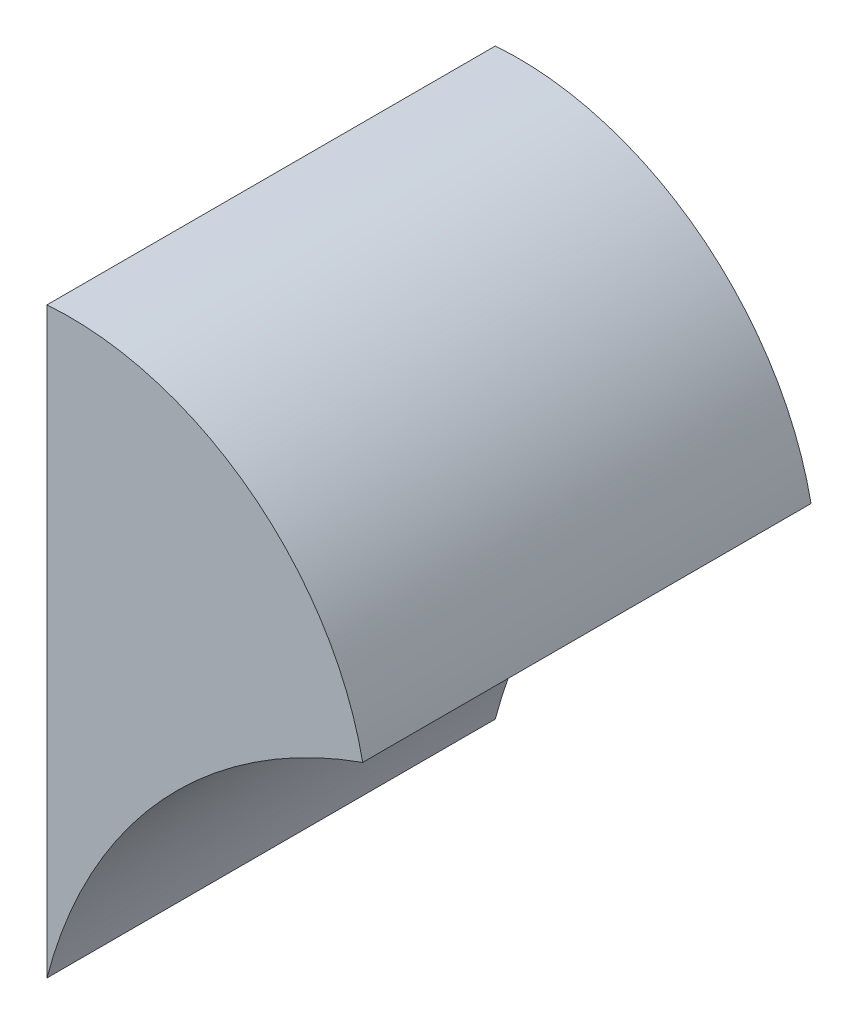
from build123d import *

# Parameters (mm, degrees)
EXTRUSION1_DEPTH = 9


with BuildPart() as part:
    # Esquisse1 → Extrusion1 (new body)
    with BuildSketch(Plane.XY):
        with BuildLine():
            Line((-26.204905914, -24.463806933), (-26.204905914, -36.165366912))
            ThreePointArc((-26.204905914, -36.165366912), (-23.897467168, -31.917888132), (-19.867332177, -29.248925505))
            ThreePointArc((-19.867332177, -29.248925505), (-22.131221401, -25.657889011), (-26.204905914, -24.463806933))
        make_face()
    extrude(amount=-EXTRUSION1_DEPTH)


solid = part.part
